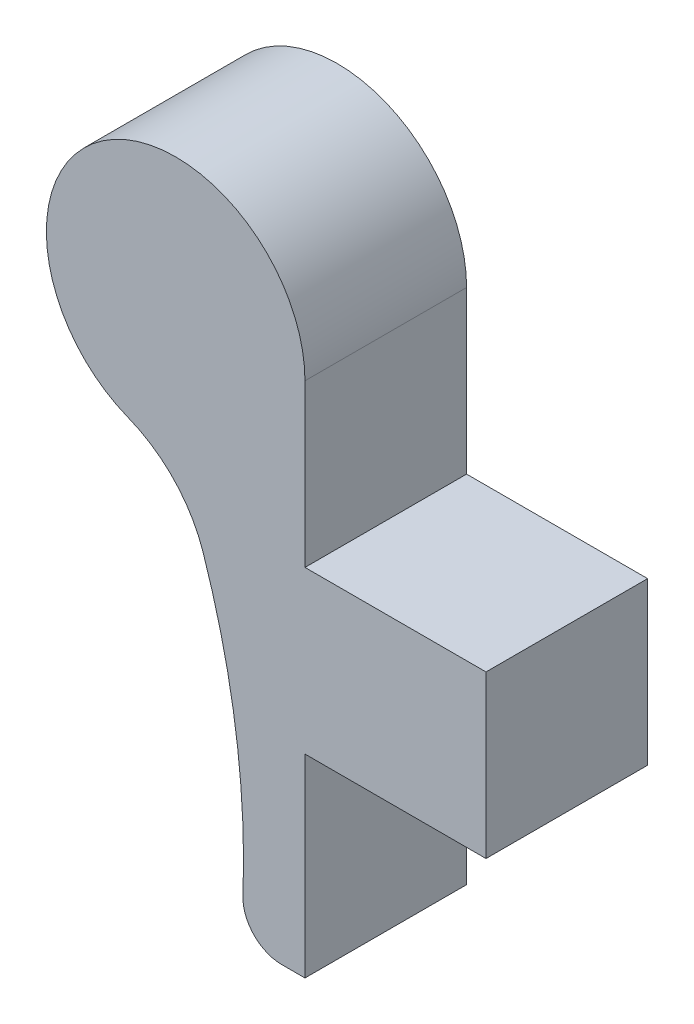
from build123d import *

# Parameters (mm, degrees)
SKETCH1_R           = 2.54
SKETCH1_R_2         = 1.5875
BOSS_EXTRUDE1_DEPTH = 3.175
FILLET1_R           = 2.54
SKETCH2_W           = 3.175
SKETCH2_H           = 3.175
SLOT_DEPTH          = 3.556
FILLET2_R           = 0.762


with BuildPart() as part:
    # Sketch1 → Boss-Extrude1 (new body)
    # profile 1 of 3: a face of its own
    with BuildSketch(Plane.XY):
        Circle(SKETCH1_R)
        Circle(SKETCH1_R_2, mode=Mode.SUBTRACT)
    # profile 2 of 3: a face of its own
    with BuildSketch(Plane.XY):
        with BuildLine():
            Line((2.54, -10.16), (2.54, 0))
            ThreePointArc((2.54, 0), (1.796051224, -1.796051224), (0, -2.54))
            ThreePointArc((0, -2.54), (1.125832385, -6.268194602), (1.27, -10.16))
            Line((1.27, -10.16), (2.54, -10.16))
        make_face()
    # profile 3 of 3: a face of its own
    with BuildSketch(Plane.XY):
        Circle(SKETCH1_R_2)
    extrude(amount=BOSS_EXTRUDE1_DEPTH)

    # Fillet1
    fillet1_edges = [part.edges().sort_by_distance(p)[0] for p in [
        (0, -2.54, 1.5875),
    ]]
    fillet(fillet1_edges, radius=FILLET1_R)

    # Sketch2 → slot (add)
    with BuildSketch(Plane(origin=(2.54, 0, 0), x_dir=(0, 0, -1), z_dir=(1, 0, 0))):
        with Locations((-1.5875, -4.7625)):
            Rectangle(SKETCH2_W, SKETCH2_H)
    extrude(amount=SLOT_DEPTH)

    # Fillet2
    fillet2_edges = [part.edges().sort_by_distance(p)[0] for p in [
        (1.27, -10.16, 1.5875),
    ]]
    fillet(fillet2_edges, radius=FILLET2_R)


solid = part.part
